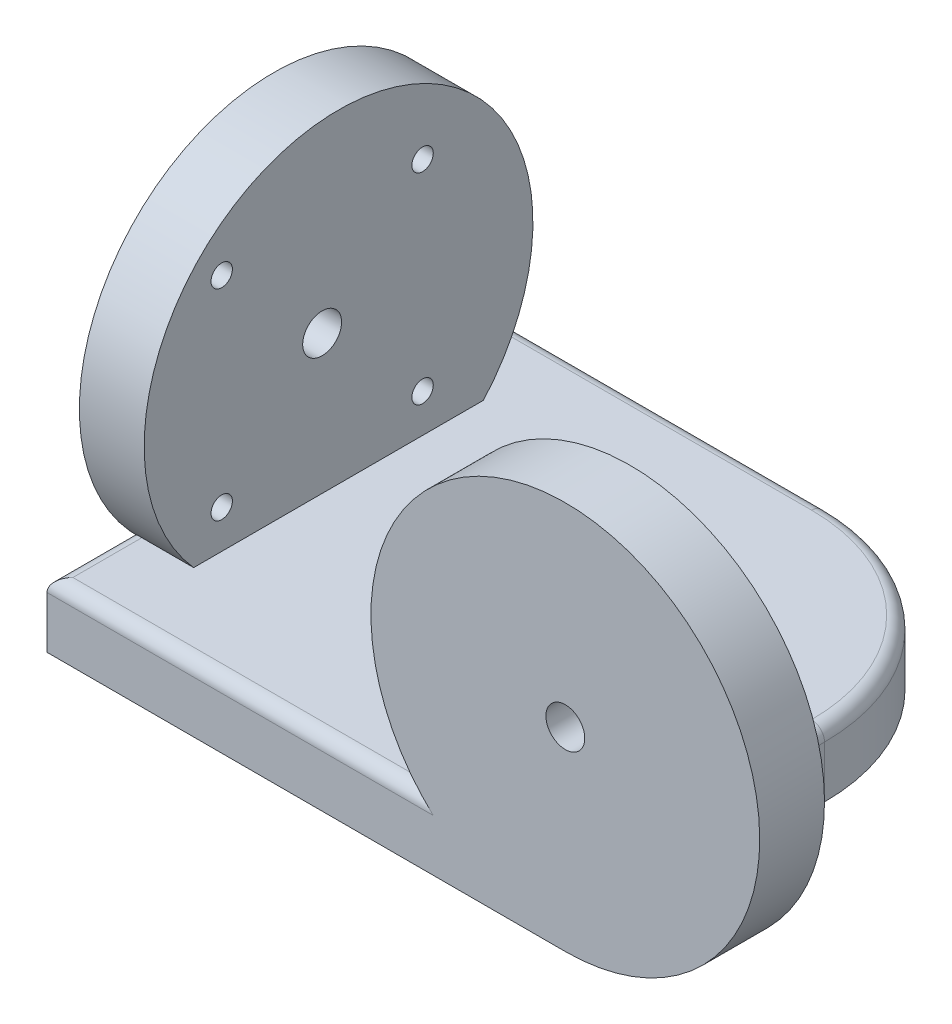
ISO-10303-21;
HEADER;
FILE_DESCRIPTION(('STEP AP214'),'2;1');
FILE_NAME('part.step','',(''),(''),'','','');
FILE_SCHEMA(('AUTOMOTIVE_DESIGN { 1 0 10303 214 1 1 1 1 }'));
ENDSEC;
DATA;
#1=APPLICATION_CONTEXT('core data for automotive mechanical design processes');
#2=APPLICATION_PROTOCOL_DEFINITION('international standard','automotive_design',2000,#1);
#3=PRODUCT_CONTEXT('',#1,'mechanical');
#4=PRODUCT('Part','Part','',(#3));
#5=PRODUCT_RELATED_PRODUCT_CATEGORY('part','',(#4));
#6=PRODUCT_DEFINITION_FORMATION('','',#4);
#7=PRODUCT_DEFINITION_CONTEXT('part definition',#1,'design');
#8=PRODUCT_DEFINITION('design','',#6,#7);
#9=PRODUCT_DEFINITION_SHAPE('','',#8);
#10=(LENGTH_UNIT() NAMED_UNIT(*) SI_UNIT(.MILLI.,.METRE.));
#11=(NAMED_UNIT(*) PLANE_ANGLE_UNIT() SI_UNIT($,.RADIAN.));
#12=(NAMED_UNIT(*) SI_UNIT($,.STERADIAN.) SOLID_ANGLE_UNIT());
#13=UNCERTAINTY_MEASURE_WITH_UNIT(LENGTH_MEASURE(1.E-05),#10,'distance_accuracy_value','');
#14=(GEOMETRIC_REPRESENTATION_CONTEXT(3) GLOBAL_UNCERTAINTY_ASSIGNED_CONTEXT((#13)) GLOBAL_UNIT_ASSIGNED_CONTEXT((#10,
#11,#12)) REPRESENTATION_CONTEXT('',''));
#15=CARTESIAN_POINT('',(0.,0.,0.));
#16=DIRECTION('',(0.,0.,1.));
#17=DIRECTION('',(1.,0.,0.));
#18=AXIS2_PLACEMENT_3D('',#15,#16,#17);
#19=CARTESIAN_POINT('',(0.,0.,10.));
#20=DIRECTION('',(0.,0.,-1.));
#21=DIRECTION('',(-1.,0.,0.));
#22=AXIS2_PLACEMENT_3D('',#19,#20,#21);
#23=CYLINDRICAL_SURFACE('',#22,30.);
#24=CARTESIAN_POINT('',(0.,0.,10.));
#25=DIRECTION('',(0.,0.,1.));
#26=DIRECTION('',(1.,0.,0.));
#27=AXIS2_PLACEMENT_3D('',#24,#25,#26);
#28=CIRCLE('',#27,30.);
#29=CARTESIAN_POINT('',(0.,-30.,10.));
#30=VERTEX_POINT('',#29);
#31=CARTESIAN_POINT('',(-20.3960780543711,-22.,10.));
#32=VERTEX_POINT('',#31);
#33=EDGE_CURVE('E54',#30,#32,#28,.T.);
#34=ORIENTED_EDGE('',*,*,#33,.F.);
#35=DIRECTION('',(0.,0.,1.));
#36=VECTOR('',#35,1.);
#37=CARTESIAN_POINT('',(0.,-30.,-60.));
#38=LINE('',#37,#36);
#39=CARTESIAN_POINT('',(0.,-30.,0.));
#40=VERTEX_POINT('',#39);
#41=EDGE_CURVE('E251',#40,#30,#38,.T.);
#42=ORIENTED_EDGE('',*,*,#41,.F.);
#43=CARTESIAN_POINT('',(0.,0.,0.));
#44=DIRECTION('',(0.,0.,1.));
#45=DIRECTION('',(1.,0.,0.));
#46=AXIS2_PLACEMENT_3D('',#43,#44,#45);
#47=CIRCLE('',#46,30.);
#48=CARTESIAN_POINT('',(-22.3606797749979,-20.,0.));
#49=VERTEX_POINT('',#48);
#50=EDGE_CURVE('E256',#40,#49,#47,.T.);
#51=ORIENTED_EDGE('',*,*,#50,.T.);
#52=DIRECTION('',(0.,0.,-1.));
#53=VECTOR('',#52,1.);
#54=CARTESIAN_POINT('',(-22.3606797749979,-20.,10.));
#55=LINE('',#54,#53);
#56=CARTESIAN_POINT('',(-22.3606797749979,-20.,8.));
#57=VERTEX_POINT('',#56);
#58=EDGE_CURVE('E250',#49,#57,#55,.F.);
#59=ORIENTED_EDGE('',*,*,#58,.T.);
#60=CARTESIAN_POINT('',(-22.3606797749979,-20.,8.));
#61=CARTESIAN_POINT('',(-22.3606878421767,-19.999989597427,8.04591763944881));
#62=CARTESIAN_POINT('',(-22.3592656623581,-20.0015809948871,8.09182840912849));
#63=CARTESIAN_POINT('',(-22.3536230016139,-20.0078877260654,8.18323544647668));
#64=CARTESIAN_POINT('',(-22.349404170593,-20.0126012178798,8.22873194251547));
#65=CARTESIAN_POINT('',(-22.3382692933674,-20.0250290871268,8.3186495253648));
#66=CARTESIAN_POINT('',(-22.3313722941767,-20.0327222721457,8.36307590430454));
#67=CARTESIAN_POINT('',(-22.3149970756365,-20.0509614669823,8.45084482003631));
#68=CARTESIAN_POINT('',(-22.3055185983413,-20.0615077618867,8.49418724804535));
#69=CARTESIAN_POINT('',(-22.2734531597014,-20.0971218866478,8.62196357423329));
#70=CARTESIAN_POINT('',(-22.2472017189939,-20.1262036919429,8.70441633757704));
#71=CARTESIAN_POINT('',(-22.1862528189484,-20.1933711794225,8.86225880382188));
#72=CARTESIAN_POINT('',(-22.1515401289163,-20.23147309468,8.93763542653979));
#73=CARTESIAN_POINT('',(-22.0621200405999,-20.3290076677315,9.10454011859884));
#74=CARTESIAN_POINT('',(-22.0046208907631,-20.3912962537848,9.19290860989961));
#75=CARTESIAN_POINT('',(-21.8800368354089,-20.5249207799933,9.35469472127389));
#76=CARTESIAN_POINT('',(-21.8129385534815,-20.5962693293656,9.42809112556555));
#77=CARTESIAN_POINT('',(-21.6466107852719,-20.7712158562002,9.58373545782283));
#78=CARTESIAN_POINT('',(-21.54439847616,-20.8773090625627,9.65996651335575));
#79=CARTESIAN_POINT('',(-21.3309886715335,-21.095315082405,9.78818478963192));
#80=CARTESIAN_POINT('',(-21.2197650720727,-21.2072444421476,9.84009839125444));
#81=CARTESIAN_POINT('',(-21.0485020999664,-21.3767886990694,9.90137564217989));
#82=CARTESIAN_POINT('',(-20.990560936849,-21.4336893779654,9.91905376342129));
#83=CARTESIAN_POINT('',(-20.8734930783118,-21.5477133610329,9.94908010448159));
#84=CARTESIAN_POINT('',(-20.8143662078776,-21.6048366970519,9.96142753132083));
#85=CARTESIAN_POINT('',(-20.6957282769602,-21.718506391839,9.980924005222));
#86=CARTESIAN_POINT('',(-20.6362250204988,-21.7750534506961,9.98811729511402));
#87=CARTESIAN_POINT('',(-20.5165822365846,-21.8878192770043,9.99765053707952));
#88=CARTESIAN_POINT('',(-20.4564430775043,-21.9440382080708,9.99999315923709));
#89=CARTESIAN_POINT('',(-20.3960780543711,-22.,10.));
#90=B_SPLINE_CURVE_WITH_KNOTS('',3,(#60,#61,#62,#63,#64,#65,#66,#67,#68,#69,#70,#71,#72,#73,#74,
#75,#76,#77,#78,#79,#80,#81,#82,#83,#84,#85,#86,#87,#88,#89),.UNSPECIFIED.,.F.,.F.,(4,2,2,2,2,2,
2,2,2,2,2,2,2,2,4),(0.,0.137692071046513,0.275302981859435,0.41195262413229,0.548615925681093,
0.821129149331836,1.09413658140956,1.45947886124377,1.82533529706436,2.3203016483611,
2.81675693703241,3.06594369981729,3.31516751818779,3.5622255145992,3.80914748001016),.UNSPECIFIED.);
#91=EDGE_CURVE('E11',#57,#32,#90,.T.);
#92=ORIENTED_EDGE('',*,*,#91,.T.);
#93=EDGE_LOOP('',(#34,#42,#51,#59,#92));
#94=FACE_BOUND('',#93,.T.);
#95=ADVANCED_FACE('F36',(#94),#23,.T.);
#96=CARTESIAN_POINT('',(0.,0.,10.));
#97=DIRECTION('',(0.,0.,1.));
#98=DIRECTION('',(1.,0.,0.));
#99=AXIS2_PLACEMENT_3D('',#96,#97,#98);
#100=PLANE('',#99);
#101=CARTESIAN_POINT('',(0.,0.,10.));
#102=DIRECTION('',(0.,0.,-1.));
#103=DIRECTION('',(-1.,0.,0.));
#104=AXIS2_PLACEMENT_3D('',#101,#102,#103);
#105=CIRCLE('',#104,3.);
#106=CARTESIAN_POINT('',(-3.,0.,10.));
#107=VERTEX_POINT('',#106);
#108=EDGE_CURVE('E222',#107,#107,#105,.T.);
#109=ORIENTED_EDGE('',*,*,#108,.T.);
#110=EDGE_LOOP('',(#109));
#111=FACE_BOUND('',#110,.T.);
#112=ORIENTED_EDGE('',*,*,#33,.T.);
#113=DIRECTION('',(-1.,0.,0.));
#114=VECTOR('',#113,1.);
#115=CARTESIAN_POINT('',(0.,-22.,10.));
#116=LINE('',#115,#114);
#117=CARTESIAN_POINT('',(-80.,-22.,10.));
#118=VERTEX_POINT('',#117);
#119=EDGE_CURVE('E294',#32,#118,#116,.T.);
#120=ORIENTED_EDGE('',*,*,#119,.T.);
#121=DIRECTION('',(0.,-1.,0.));
#122=VECTOR('',#121,1.);
#123=CARTESIAN_POINT('',(-80.,-30.,10.));
#124=LINE('',#123,#122);
#125=CARTESIAN_POINT('',(-80.,-30.,10.));
#126=VERTEX_POINT('',#125);
#127=EDGE_CURVE('E238',#118,#126,#124,.T.);
#128=ORIENTED_EDGE('',*,*,#127,.T.);
#129=DIRECTION('',(1.,0.,0.));
#130=VECTOR('',#129,1.);
#131=CARTESIAN_POINT('',(0.,-30.,10.));
#132=LINE('',#131,#130);
#133=EDGE_CURVE('E242',#126,#30,#132,.T.);
#134=ORIENTED_EDGE('',*,*,#133,.T.);
#135=EDGE_LOOP('',(#112,#120,#128,#134));
#136=FACE_BOUND('',#135,.T.);
#137=ADVANCED_FACE('F342',(#111,#136),#100,.T.);
#138=CARTESIAN_POINT('',(0.,0.,0.));
#139=DIRECTION('',(0.,0.,1.));
#140=DIRECTION('',(1.,0.,0.));
#141=AXIS2_PLACEMENT_3D('',#138,#139,#140);
#142=PLANE('',#141);
#143=CARTESIAN_POINT('',(15.5,15.5,0.));
#144=DIRECTION('',(0.,0.,-1.));
#145=DIRECTION('',(-1.,0.,0.));
#146=AXIS2_PLACEMENT_3D('',#143,#144,#145);
#147=CIRCLE('',#146,1.64999999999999);
#148=CARTESIAN_POINT('',(13.85,15.5,0.));
#149=VERTEX_POINT('',#148);
#150=EDGE_CURVE('E195',#149,#149,#147,.T.);
#151=ORIENTED_EDGE('',*,*,#150,.F.);
#152=EDGE_LOOP('',(#151));
#153=FACE_BOUND('',#152,.T.);
#154=CARTESIAN_POINT('',(-15.5,15.5,0.));
#155=DIRECTION('',(0.,0.,-1.));
#156=DIRECTION('',(-1.,0.,0.));
#157=AXIS2_PLACEMENT_3D('',#154,#155,#156);
#158=CIRCLE('',#157,1.64999999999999);
#159=CARTESIAN_POINT('',(-17.15,15.5,0.));
#160=VERTEX_POINT('',#159);
#161=EDGE_CURVE('E201',#160,#160,#158,.T.);
#162=ORIENTED_EDGE('',*,*,#161,.F.);
#163=EDGE_LOOP('',(#162));
#164=FACE_BOUND('',#163,.T.);
#165=CARTESIAN_POINT('',(-15.5,-15.5,0.));
#166=DIRECTION('',(0.,0.,-1.));
#167=DIRECTION('',(-1.,0.,0.));
#168=AXIS2_PLACEMENT_3D('',#165,#166,#167);
#169=CIRCLE('',#168,1.64999999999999);
#170=CARTESIAN_POINT('',(-17.15,-15.5,0.));
#171=VERTEX_POINT('',#170);
#172=EDGE_CURVE('E207',#171,#171,#169,.T.);
#173=ORIENTED_EDGE('',*,*,#172,.F.);
#174=EDGE_LOOP('',(#173));
#175=FACE_BOUND('',#174,.T.);
#176=CARTESIAN_POINT('',(15.5,-15.5,0.));
#177=DIRECTION('',(0.,0.,-1.));
#178=DIRECTION('',(-1.,0.,0.));
#179=AXIS2_PLACEMENT_3D('',#176,#177,#178);
#180=CIRCLE('',#179,1.64999999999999);
#181=CARTESIAN_POINT('',(13.85,-15.5,0.));
#182=VERTEX_POINT('',#181);
#183=EDGE_CURVE('E213',#182,#182,#180,.T.);
#184=ORIENTED_EDGE('',*,*,#183,.F.);
#185=EDGE_LOOP('',(#184));
#186=FACE_BOUND('',#185,.T.);
#187=CARTESIAN_POINT('',(0.,0.,0.));
#188=DIRECTION('',(0.,0.,-1.));
#189=DIRECTION('',(-1.,0.,0.));
#190=AXIS2_PLACEMENT_3D('',#187,#188,#189);
#191=CIRCLE('',#190,2.99999999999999);
#192=CARTESIAN_POINT('',(-2.99999999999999,0.,0.));
#193=VERTEX_POINT('',#192);
#194=EDGE_CURVE('E219',#193,#193,#191,.T.);
#195=ORIENTED_EDGE('',*,*,#194,.F.);
#196=EDGE_LOOP('',(#195));
#197=FACE_BOUND('',#196,.T.);
#198=ORIENTED_EDGE('',*,*,#50,.F.);
#199=DIRECTION('',(0.,1.,0.));
#200=VECTOR('',#199,1.);
#201=CARTESIAN_POINT('',(0.,0.,0.));
#202=LINE('',#201,#200);
#203=CARTESIAN_POINT('',(0.,-22.,0.));
#204=VERTEX_POINT('',#203);
#205=EDGE_CURVE('E262',#40,#204,#202,.T.);
#206=ORIENTED_EDGE('',*,*,#205,.T.);
#207=CARTESIAN_POINT('',(-2.,-22.,0.));
#208=DIRECTION('',(0.,0.,1.));
#209=DIRECTION('',(1.,0.,0.));
#210=AXIS2_PLACEMENT_3D('',#207,#208,#209);
#211=CIRCLE('',#210,2.);
#212=CARTESIAN_POINT('',(-2.,-20.,0.));
#213=VERTEX_POINT('',#212);
#214=EDGE_CURVE('E46',#204,#213,#211,.T.);
#215=ORIENTED_EDGE('',*,*,#214,.T.);
#216=DIRECTION('',(-1.,0.,0.));
#217=VECTOR('',#216,1.);
#218=CARTESIAN_POINT('',(0.,-20.,0.));
#219=LINE('',#218,#217);
#220=EDGE_CURVE('E258',#213,#49,#219,.T.);
#221=ORIENTED_EDGE('',*,*,#220,.T.);
#222=EDGE_LOOP('',(#198,#206,#215,#221));
#223=FACE_BOUND('',#222,.T.);
#224=ADVANCED_FACE('F341',(#153,#164,#175,#186,#197,#223),#142,.F.);
#225=CARTESIAN_POINT('',(0.,-30.,-60.));
#226=DIRECTION('',(1.,0.,0.));
#227=DIRECTION('',(0.,0.,-1.));
#228=AXIS2_PLACEMENT_3D('',#225,#226,#227);
#229=PLANE('',#228);
#230=DIRECTION('',(0.,1.,0.));
#231=VECTOR('',#230,1.);
#232=CARTESIAN_POINT('',(0.,-20.,-30.));
#233=LINE('',#232,#231);
#234=CARTESIAN_POINT('',(0.,-30.,-30.));
#235=VERTEX_POINT('',#234);
#236=CARTESIAN_POINT('',(0.,-22.,-30.));
#237=VERTEX_POINT('',#236);
#238=EDGE_CURVE('E264',#235,#237,#233,.T.);
#239=ORIENTED_EDGE('',*,*,#238,.T.);
#240=DIRECTION('',(0.,0.,1.));
#241=VECTOR('',#240,1.);
#242=CARTESIAN_POINT('',(0.,-22.,-60.));
#243=LINE('',#242,#241);
#244=EDGE_CURVE('E61',#237,#204,#243,.T.);
#245=ORIENTED_EDGE('',*,*,#244,.T.);
#246=ORIENTED_EDGE('',*,*,#205,.F.);
#247=EDGE_CURVE('E248',#235,#40,#38,.T.);
#248=ORIENTED_EDGE('',*,*,#247,.F.);
#249=EDGE_LOOP('',(#239,#245,#246,#248));
#250=FACE_BOUND('',#249,.T.);
#251=ADVANCED_FACE('F337',(#250),#229,.T.);
#252=CARTESIAN_POINT('',(0.,-20.,-60.));
#253=DIRECTION('',(0.,1.,0.));
#254=DIRECTION('',(-1.,0.,0.));
#255=AXIS2_PLACEMENT_3D('',#252,#253,#254);
#256=PLANE('',#255);
#257=DIRECTION('',(-1.,0.,0.));
#258=VECTOR('',#257,1.);
#259=CARTESIAN_POINT('',(-80.,-20.,-58.));
#260=LINE('',#259,#258);
#261=CARTESIAN_POINT('',(-30.,-20.,-58.));
#262=VERTEX_POINT('',#261);
#263=CARTESIAN_POINT('',(-78.,-20.,-58.));
#264=VERTEX_POINT('',#263);
#265=EDGE_CURVE('E279',#262,#264,#260,.T.);
#266=ORIENTED_EDGE('',*,*,#265,.T.);
#267=DIRECTION('',(0.,0.,1.));
#268=VECTOR('',#267,1.);
#269=CARTESIAN_POINT('',(-78.,-20.,-60.));
#270=LINE('',#269,#268);
#271=CARTESIAN_POINT('',(-78.,-20.,-47.3606797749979));
#272=VERTEX_POINT('',#271);
#273=EDGE_CURVE('E282',#264,#272,#270,.T.);
#274=ORIENTED_EDGE('',*,*,#273,.T.);
#275=DIRECTION('',(-1.,0.,0.));
#276=VECTOR('',#275,1.);
#277=CARTESIAN_POINT('',(-70.,-20.,-47.3606797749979));
#278=LINE('',#277,#276);
#279=CARTESIAN_POINT('',(-70.,-20.,-47.3606797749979));
#280=VERTEX_POINT('',#279);
#281=EDGE_CURVE('E232',#280,#272,#278,.T.);
#282=ORIENTED_EDGE('',*,*,#281,.F.);
#283=DIRECTION('',(0.,0.,1.));
#284=VECTOR('',#283,1.);
#285=CARTESIAN_POINT('',(-70.,-20.,-60.));
#286=LINE('',#285,#284);
#287=CARTESIAN_POINT('',(-70.,-20.,-2.6393202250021));
#288=VERTEX_POINT('',#287);
#289=EDGE_CURVE('E235',#280,#288,#286,.T.);
#290=ORIENTED_EDGE('',*,*,#289,.T.);
#291=DIRECTION('',(-1.,0.,0.));
#292=VECTOR('',#291,1.);
#293=CARTESIAN_POINT('',(-70.,-20.,-2.6393202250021));
#294=LINE('',#293,#292);
#295=CARTESIAN_POINT('',(-78.,-20.,-2.6393202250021));
#296=VERTEX_POINT('',#295);
#297=EDGE_CURVE('E229',#296,#288,#294,.F.);
#298=ORIENTED_EDGE('',*,*,#297,.F.);
#299=DIRECTION('',(0.,0.,1.));
#300=VECTOR('',#299,1.);
#301=CARTESIAN_POINT('',(-78.,-20.,-60.));
#302=LINE('',#301,#300);
#303=CARTESIAN_POINT('',(-78.,-20.,8.));
#304=VERTEX_POINT('',#303);
#305=EDGE_CURVE('E272',#296,#304,#302,.T.);
#306=ORIENTED_EDGE('',*,*,#305,.T.);
#307=DIRECTION('',(-1.,0.,0.));
#308=VECTOR('',#307,1.);
#309=CARTESIAN_POINT('',(0.,-20.,8.));
#310=LINE('',#309,#308);
#311=EDGE_CURVE('E270',#304,#57,#310,.F.);
#312=ORIENTED_EDGE('',*,*,#311,.T.);
#313=ORIENTED_EDGE('',*,*,#58,.F.);
#314=ORIENTED_EDGE('',*,*,#220,.F.);
#315=DIRECTION('',(0.,0.,1.));
#316=VECTOR('',#315,1.);
#317=CARTESIAN_POINT('',(-2.,-20.,-60.));
#318=LINE('',#317,#316);
#319=CARTESIAN_POINT('',(-2.,-20.,-30.));
#320=VERTEX_POINT('',#319);
#321=EDGE_CURVE('E275',#213,#320,#318,.F.);
#322=ORIENTED_EDGE('',*,*,#321,.T.);
#323=CARTESIAN_POINT('',(-30.,-20.,-30.));
#324=DIRECTION('',(0.,1.,0.));
#325=DIRECTION('',(-1.,0.,0.));
#326=AXIS2_PLACEMENT_3D('',#323,#324,#325);
#327=CIRCLE('',#326,28.);
#328=EDGE_CURVE('E277',#320,#262,#327,.T.);
#329=ORIENTED_EDGE('',*,*,#328,.T.);
#330=EDGE_LOOP('',(#266,#274,#282,#290,#298,#306,#312,#313,#314,#322,#329));
#331=FACE_BOUND('',#330,.T.);
#332=ADVANCED_FACE('F330',(#331),#256,.T.);
#333=CARTESIAN_POINT('',(0.,-30.,-60.));
#334=DIRECTION('',(0.,-1.,0.));
#335=DIRECTION('',(1.,0.,0.));
#336=AXIS2_PLACEMENT_3D('',#333,#334,#335);
#337=PLANE('',#336);
#338=DIRECTION('',(1.,0.,0.));
#339=VECTOR('',#338,1.);
#340=CARTESIAN_POINT('',(0.,-30.,-60.));
#341=LINE('',#340,#339);
#342=CARTESIAN_POINT('',(-80.,-30.,-60.));
#343=VERTEX_POINT('',#342);
#344=CARTESIAN_POINT('',(-30.,-30.,-60.));
#345=VERTEX_POINT('',#344);
#346=EDGE_CURVE('E241',#343,#345,#341,.T.);
#347=ORIENTED_EDGE('',*,*,#346,.T.);
#348=CARTESIAN_POINT('',(-30.,-30.,-30.));
#349=DIRECTION('',(0.,-1.,0.));
#350=DIRECTION('',(1.,0.,0.));
#351=AXIS2_PLACEMENT_3D('',#348,#349,#350);
#352=CIRCLE('',#351,30.);
#353=EDGE_CURVE('E268',#345,#235,#352,.T.);
#354=ORIENTED_EDGE('',*,*,#353,.T.);
#355=ORIENTED_EDGE('',*,*,#247,.T.);
#356=ORIENTED_EDGE('',*,*,#41,.T.);
#357=ORIENTED_EDGE('',*,*,#133,.F.);
#358=DIRECTION('',(0.,0.,1.));
#359=VECTOR('',#358,1.);
#360=CARTESIAN_POINT('',(-80.,-30.,-60.));
#361=LINE('',#360,#359);
#362=EDGE_CURVE('E245',#343,#126,#361,.T.);
#363=ORIENTED_EDGE('',*,*,#362,.F.);
#364=EDGE_LOOP('',(#347,#354,#355,#356,#357,#363));
#365=FACE_BOUND('',#364,.T.);
#366=ADVANCED_FACE('F327',(#365),#337,.T.);
#367=CARTESIAN_POINT('',(-80.,-30.,-60.));
#368=DIRECTION('',(-1.,0.,0.));
#369=DIRECTION('',(0.,0.,1.));
#370=AXIS2_PLACEMENT_3D('',#367,#368,#369);
#371=PLANE('',#370);
#372=CARTESIAN_POINT('',(-80.,1.40707775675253,-22.4690416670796));
#373=DIRECTION('',(1.,0.,0.));
#374=DIRECTION('',(0.,0.,-1.));
#375=AXIS2_PLACEMENT_3D('',#372,#373,#374);
#376=CIRCLE('',#375,3.);
#377=CARTESIAN_POINT('',(-80.,1.40707775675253,-25.4690416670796));
#378=VERTEX_POINT('',#377);
#379=EDGE_CURVE('E192',#378,#378,#376,.T.);
#380=ORIENTED_EDGE('',*,*,#379,.T.);
#381=EDGE_LOOP('',(#380));
#382=FACE_BOUND('',#381,.T.);
#383=CARTESIAN_POINT('',(-80.,0.,-25.));
#384=DIRECTION('',(-1.,0.,0.));
#385=DIRECTION('',(0.,0.,1.));
#386=AXIS2_PLACEMENT_3D('',#383,#384,#385);
#387=CIRCLE('',#386,30.);
#388=CARTESIAN_POINT('',(-80.,-22.,-4.60392194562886));
#389=VERTEX_POINT('',#388);
#390=CARTESIAN_POINT('',(-80.,-22.,-45.3960780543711));
#391=VERTEX_POINT('',#390);
#392=EDGE_CURVE('E225',#389,#391,#387,.T.);
#393=ORIENTED_EDGE('',*,*,#392,.T.);
#394=DIRECTION('',(0.,0.,1.));
#395=VECTOR('',#394,1.);
#396=CARTESIAN_POINT('',(-80.,-22.,-60.));
#397=LINE('',#396,#395);
#398=CARTESIAN_POINT('',(-80.,-22.,-60.));
#399=VERTEX_POINT('',#398);
#400=EDGE_CURVE('E291',#391,#399,#397,.F.);
#401=ORIENTED_EDGE('',*,*,#400,.T.);
#402=DIRECTION('',(0.,-1.,0.));
#403=VECTOR('',#402,1.);
#404=CARTESIAN_POINT('',(-80.,-30.,-60.));
#405=LINE('',#404,#403);
#406=EDGE_CURVE('E239',#399,#343,#405,.T.);
#407=ORIENTED_EDGE('',*,*,#406,.T.);
#408=ORIENTED_EDGE('',*,*,#362,.T.);
#409=ORIENTED_EDGE('',*,*,#127,.F.);
#410=DIRECTION('',(0.,0.,1.));
#411=VECTOR('',#410,1.);
#412=CARTESIAN_POINT('',(-80.,-22.,-60.));
#413=LINE('',#412,#411);
#414=EDGE_CURVE('E288',#118,#389,#413,.F.);
#415=ORIENTED_EDGE('',*,*,#414,.T.);
#416=EDGE_LOOP('',(#393,#401,#407,#408,#409,#415));
#417=FACE_BOUND('',#416,.T.);
#418=ADVANCED_FACE('F325',(#382,#417),#371,.T.);
#419=CARTESIAN_POINT('',(0.,0.,-60.));
#420=DIRECTION('',(0.,0.,1.));
#421=DIRECTION('',(1.,0.,0.));
#422=AXIS2_PLACEMENT_3D('',#419,#420,#421);
#423=PLANE('',#422);
#424=ORIENTED_EDGE('',*,*,#406,.F.);
#425=DIRECTION('',(-1.,0.,0.));
#426=VECTOR('',#425,1.);
#427=CARTESIAN_POINT('',(-30.,-22.,-60.));
#428=LINE('',#427,#426);
#429=CARTESIAN_POINT('',(-30.,-22.,-60.));
#430=VERTEX_POINT('',#429);
#431=EDGE_CURVE('E284',#399,#430,#428,.F.);
#432=ORIENTED_EDGE('',*,*,#431,.T.);
#433=DIRECTION('',(0.,1.,0.));
#434=VECTOR('',#433,1.);
#435=CARTESIAN_POINT('',(-30.,-30.,-60.));
#436=LINE('',#435,#434);
#437=EDGE_CURVE('E266',#430,#345,#436,.F.);
#438=ORIENTED_EDGE('',*,*,#437,.T.);
#439=ORIENTED_EDGE('',*,*,#346,.F.);
#440=EDGE_LOOP('',(#424,#432,#438,#439));
#441=FACE_BOUND('',#440,.T.);
#442=ADVANCED_FACE('F319',(#441),#423,.F.);
#443=CARTESIAN_POINT('',(-70.,0.,-25.));
#444=DIRECTION('',(-1.,0.,0.));
#445=DIRECTION('',(0.,0.,1.));
#446=AXIS2_PLACEMENT_3D('',#443,#444,#445);
#447=CYLINDRICAL_SURFACE('',#446,30.);
#448=CARTESIAN_POINT('',(-70.,0.,-25.));
#449=DIRECTION('',(-1.,0.,0.));
#450=DIRECTION('',(0.,0.,1.));
#451=AXIS2_PLACEMENT_3D('',#448,#449,#450);
#452=CIRCLE('',#451,30.);
#453=EDGE_CURVE('E226',#288,#280,#452,.T.);
#454=ORIENTED_EDGE('',*,*,#453,.T.);
#455=ORIENTED_EDGE('',*,*,#281,.T.);
#456=CARTESIAN_POINT('',(-78.,-20.,-47.3606797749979));
#457=CARTESIAN_POINT('',(-78.0459176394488,-19.999989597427,-47.3606878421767));
#458=CARTESIAN_POINT('',(-78.0918284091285,-20.0015809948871,-47.3592656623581));
#459=CARTESIAN_POINT('',(-78.1832354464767,-20.0078877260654,-47.3536230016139));
#460=CARTESIAN_POINT('',(-78.2287319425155,-20.0126012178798,-47.349404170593));
#461=CARTESIAN_POINT('',(-78.3186495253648,-20.0250290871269,-47.3382692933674));
#462=CARTESIAN_POINT('',(-78.3630759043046,-20.0327222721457,-47.3313722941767));
#463=CARTESIAN_POINT('',(-78.4508448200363,-20.0509614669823,-47.3149970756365));
#464=CARTESIAN_POINT('',(-78.4941872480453,-20.0615077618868,-47.3055185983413));
#465=CARTESIAN_POINT('',(-78.6219635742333,-20.0971218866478,-47.2734531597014));
#466=CARTESIAN_POINT('',(-78.704416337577,-20.126203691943,-47.2472017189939));
#467=CARTESIAN_POINT('',(-78.8622588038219,-20.1933711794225,-47.1862528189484));
#468=CARTESIAN_POINT('',(-78.9376354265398,-20.23147309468,-47.1515401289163));
#469=CARTESIAN_POINT('',(-79.1045401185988,-20.3290076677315,-47.0621200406));
#470=CARTESIAN_POINT('',(-79.1929086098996,-20.3912962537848,-47.0046208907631));
#471=CARTESIAN_POINT('',(-79.3546947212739,-20.5249207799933,-46.8800368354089));
#472=CARTESIAN_POINT('',(-79.4280911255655,-20.5962693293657,-46.8129385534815));
#473=CARTESIAN_POINT('',(-79.5837354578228,-20.7712158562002,-46.6466107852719));
#474=CARTESIAN_POINT('',(-79.6599665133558,-20.8773090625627,-46.54439847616));
#475=CARTESIAN_POINT('',(-79.7881847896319,-21.095315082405,-46.3309886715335));
#476=CARTESIAN_POINT('',(-79.8400983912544,-21.2072444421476,-46.2197650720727));
#477=CARTESIAN_POINT('',(-79.9013756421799,-21.3767886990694,-46.0485020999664));
#478=CARTESIAN_POINT('',(-79.9190537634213,-21.4336893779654,-45.990560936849));
#479=CARTESIAN_POINT('',(-79.9490801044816,-21.5477133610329,-45.8734930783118));
#480=CARTESIAN_POINT('',(-79.9614275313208,-21.6048366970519,-45.8143662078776));
#481=CARTESIAN_POINT('',(-79.980924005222,-21.718506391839,-45.6957282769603));
#482=CARTESIAN_POINT('',(-79.988117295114,-21.7750534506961,-45.6362250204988));
#483=CARTESIAN_POINT('',(-79.9976505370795,-21.8878192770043,-45.5165822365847));
#484=CARTESIAN_POINT('',(-79.9999931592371,-21.9440382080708,-45.4564430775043));
#485=CARTESIAN_POINT('',(-80.,-22.,-45.3960780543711));
#486=B_SPLINE_CURVE_WITH_KNOTS('',3,(#456,#457,#458,#459,#460,#461,#462,#463,#464,#465,#466,
#467,#468,#469,#470,#471,#472,#473,#474,#475,#476,#477,#478,#479,#480,#481,#482,#483,#484,#485),
.UNSPECIFIED.,.F.,.F.,(4,2,2,2,2,2,2,2,2,2,2,2,2,2,4),(0.,0.137692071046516,0.275302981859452,
0.411952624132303,0.548615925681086,0.821129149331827,1.09413658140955,1.45947886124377,
1.82533529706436,2.3203016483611,2.81675693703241,3.06594369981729,3.31516751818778,
3.5622255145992,3.80914748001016),.UNSPECIFIED.);
#487=EDGE_CURVE('E296',#272,#391,#486,.T.);
#488=ORIENTED_EDGE('',*,*,#487,.T.);
#489=ORIENTED_EDGE('',*,*,#392,.F.);
#490=CARTESIAN_POINT('',(-80.,-22.,-4.60392194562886));
#491=CARTESIAN_POINT('',(-79.9999786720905,-21.9250969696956,-4.52311990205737));
#492=CARTESIAN_POINT('',(-79.9957893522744,-21.849713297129,-4.44270947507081));
#493=CARTESIAN_POINT('',(-79.9786015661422,-21.6983829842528,-4.28304540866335));
#494=CARTESIAN_POINT('',(-79.9655837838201,-21.6224354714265,-4.20379469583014));
#495=CARTESIAN_POINT('',(-79.9300679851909,-21.4698763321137,-4.04632308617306));
#496=CARTESIAN_POINT('',(-79.9074674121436,-21.3932665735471,-3.96812306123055));
#497=CARTESIAN_POINT('',(-79.8521922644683,-21.2410983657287,-3.814452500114));
#498=CARTESIAN_POINT('',(-79.8195278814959,-21.165538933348,-3.73897928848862));
#499=CARTESIAN_POINT('',(-79.7325264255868,-20.9950355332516,-3.57042646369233));
#500=CARTESIAN_POINT('',(-79.6746633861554,-20.9007232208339,-3.4784796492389));
#501=CARTESIAN_POINT('',(-79.5397533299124,-20.7186202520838,-3.30311860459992));
#502=CARTESIAN_POINT('',(-79.4627795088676,-20.6308063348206,-3.21967349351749));
#503=CARTESIAN_POINT('',(-79.3070493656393,-20.4832444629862,-3.08095136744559));
#504=CARTESIAN_POINT('',(-79.2321712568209,-20.4215041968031,-3.02346171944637));
#505=CARTESIAN_POINT('',(-79.069729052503,-20.3072185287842,-2.91781445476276));
#506=CARTESIAN_POINT('',(-78.9821736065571,-20.2546669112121,-2.869650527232));
#507=CARTESIAN_POINT('',(-78.8120722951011,-20.1702774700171,-2.79273579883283));
#508=CARTESIAN_POINT('',(-78.7314065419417,-20.1364178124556,-2.7620556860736));
#509=CARTESIAN_POINT('',(-78.5636540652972,-20.0790322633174,-2.71022738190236));
#510=CARTESIAN_POINT('',(-78.4765795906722,-20.0554872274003,-2.68906152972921));
#511=CARTESIAN_POINT('',(-78.3243499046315,-20.0254289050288,-2.66208405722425));
#512=CARTESIAN_POINT('',(-78.2602372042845,-20.0159477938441,-2.65359177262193));
#513=CARTESIAN_POINT('',(-78.1307701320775,-20.0032088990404,-2.64219033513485));
#514=CARTESIAN_POINT('',(-78.0654133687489,-19.999964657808,-2.63929333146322));
#515=CARTESIAN_POINT('',(-78.,-20.,-2.6393202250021));
#516=B_SPLINE_CURVE_WITH_KNOTS('',3,(#490,#491,#492,#493,#494,#495,#496,#497,#498,#499,#500,
#501,#502,#503,#504,#505,#506,#507,#508,#509,#510,#511,#512,#513,#514,#515),.UNSPECIFIED.,.F.,
.F.,(4,2,2,2,2,2,2,2,2,2,2,2,4),(0.,0.330515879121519,0.661757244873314,0.996636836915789,
1.33117840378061,1.7613310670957,2.18986096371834,2.52703574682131,2.86398155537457,
3.14098050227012,3.41746312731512,3.61303525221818,3.80903155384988),.UNSPECIFIED.);
#517=EDGE_CURVE('E304',#389,#296,#516,.T.);
#518=ORIENTED_EDGE('',*,*,#517,.T.);
#519=ORIENTED_EDGE('',*,*,#297,.T.);
#520=EDGE_LOOP('',(#454,#455,#488,#489,#518,#519));
#521=FACE_BOUND('',#520,.T.);
#522=ADVANCED_FACE('F313',(#521),#447,.T.);
#523=CARTESIAN_POINT('',(-70.,0.,-25.));
#524=DIRECTION('',(-1.,0.,0.));
#525=DIRECTION('',(0.,0.,1.));
#526=AXIS2_PLACEMENT_3D('',#523,#524,#525);
#527=PLANE('',#526);
#528=CARTESIAN_POINT('',(-70.,16.9070777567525,-6.96904166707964));
#529=DIRECTION('',(1.,0.,0.));
#530=DIRECTION('',(0.,0.,-1.));
#531=AXIS2_PLACEMENT_3D('',#528,#529,#530);
#532=CIRCLE('',#531,1.64999999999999);
#533=CARTESIAN_POINT('',(-70.,16.9070777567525,-8.61904166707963));
#534=VERTEX_POINT('',#533);
#535=EDGE_CURVE('E166',#534,#534,#532,.T.);
#536=ORIENTED_EDGE('',*,*,#535,.F.);
#537=EDGE_LOOP('',(#536));
#538=FACE_BOUND('',#537,.T.);
#539=CARTESIAN_POINT('',(-70.,16.9070777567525,-37.9690416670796));
#540=DIRECTION('',(1.,0.,0.));
#541=DIRECTION('',(0.,0.,-1.));
#542=AXIS2_PLACEMENT_3D('',#539,#540,#541);
#543=CIRCLE('',#542,1.64999999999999);
#544=CARTESIAN_POINT('',(-70.,16.9070777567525,-39.6190416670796));
#545=VERTEX_POINT('',#544);
#546=EDGE_CURVE('E165',#545,#545,#543,.T.);
#547=ORIENTED_EDGE('',*,*,#546,.F.);
#548=EDGE_LOOP('',(#547));
#549=FACE_BOUND('',#548,.T.);
#550=CARTESIAN_POINT('',(-70.,-14.0929222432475,-37.9690416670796));
#551=DIRECTION('',(1.,0.,0.));
#552=DIRECTION('',(0.,0.,-1.));
#553=AXIS2_PLACEMENT_3D('',#550,#551,#552);
#554=CIRCLE('',#553,1.64999999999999);
#555=CARTESIAN_POINT('',(-70.,-14.0929222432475,-39.6190416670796));
#556=VERTEX_POINT('',#555);
#557=EDGE_CURVE('E177',#556,#556,#554,.T.);
#558=ORIENTED_EDGE('',*,*,#557,.F.);
#559=EDGE_LOOP('',(#558));
#560=FACE_BOUND('',#559,.T.);
#561=CARTESIAN_POINT('',(-70.,-14.0929222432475,-6.96904166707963));
#562=DIRECTION('',(1.,0.,0.));
#563=DIRECTION('',(0.,0.,-1.));
#564=AXIS2_PLACEMENT_3D('',#561,#562,#563);
#565=CIRCLE('',#564,1.64999999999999);
#566=CARTESIAN_POINT('',(-70.,-14.0929222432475,-8.61904166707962));
#567=VERTEX_POINT('',#566);
#568=EDGE_CURVE('E183',#567,#567,#565,.T.);
#569=ORIENTED_EDGE('',*,*,#568,.F.);
#570=EDGE_LOOP('',(#569));
#571=FACE_BOUND('',#570,.T.);
#572=CARTESIAN_POINT('',(-70.,1.40707775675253,-22.4690416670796));
#573=DIRECTION('',(1.,0.,0.));
#574=DIRECTION('',(0.,0.,-1.));
#575=AXIS2_PLACEMENT_3D('',#572,#573,#574);
#576=CIRCLE('',#575,2.99999999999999);
#577=CARTESIAN_POINT('',(-70.,1.40707775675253,-25.4690416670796));
#578=VERTEX_POINT('',#577);
#579=EDGE_CURVE('E189',#578,#578,#576,.T.);
#580=ORIENTED_EDGE('',*,*,#579,.F.);
#581=EDGE_LOOP('',(#580));
#582=FACE_BOUND('',#581,.T.);
#583=ORIENTED_EDGE('',*,*,#289,.F.);
#584=ORIENTED_EDGE('',*,*,#453,.F.);
#585=EDGE_LOOP('',(#583,#584));
#586=FACE_BOUND('',#585,.T.);
#587=ADVANCED_FACE('F318',(#538,#549,#560,#571,#582,#586),#527,.F.);
#588=CARTESIAN_POINT('',(0.,0.,0.));
#589=DIRECTION('',(0.,0.,-1.));
#590=DIRECTION('',(-1.,0.,0.));
#591=AXIS2_PLACEMENT_3D('',#588,#589,#590);
#592=CYLINDRICAL_SURFACE('',#591,2.99999999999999);
#593=ORIENTED_EDGE('',*,*,#108,.F.);
#594=EDGE_LOOP('',(#593));
#595=FACE_BOUND('',#594,.T.);
#596=ORIENTED_EDGE('',*,*,#194,.T.);
#597=EDGE_LOOP('',(#596));
#598=FACE_BOUND('',#597,.T.);
#599=ADVANCED_FACE('F402',(#595,#598),#592,.F.);
#600=CARTESIAN_POINT('',(15.5,-15.5,6.));
#601=DIRECTION('',(0.,0.,-1.));
#602=DIRECTION('',(-1.,0.,0.));
#603=AXIS2_PLACEMENT_3D('',#600,#601,#602);
#604=CONICAL_SURFACE('',#603,1.65,1.02974425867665);
#605=CARTESIAN_POINT('',(15.5,-15.5,6.99142002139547));
#606=VERTEX_POINT('',#605);
#607=VERTEX_LOOP('',#606);
#608=FACE_BOUND('',#607,.T.);
#609=CARTESIAN_POINT('',(15.5,-15.5,6.));
#610=DIRECTION('',(0.,0.,-1.));
#611=DIRECTION('',(-1.,0.,0.));
#612=AXIS2_PLACEMENT_3D('',#609,#610,#611);
#613=CIRCLE('',#612,1.65);
#614=CARTESIAN_POINT('',(13.85,-15.5,6.));
#615=VERTEX_POINT('',#614);
#616=EDGE_CURVE('E216',#615,#615,#613,.T.);
#617=ORIENTED_EDGE('',*,*,#616,.T.);
#618=EDGE_LOOP('',(#617));
#619=FACE_BOUND('',#618,.T.);
#620=ADVANCED_FACE('F407',(#608,#619),#604,.F.);
#621=CARTESIAN_POINT('',(15.5,-15.5,0.));
#622=DIRECTION('',(0.,0.,-1.));
#623=DIRECTION('',(-1.,0.,0.));
#624=AXIS2_PLACEMENT_3D('',#621,#622,#623);
#625=CYLINDRICAL_SURFACE('',#624,1.64999999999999);
#626=ORIENTED_EDGE('',*,*,#616,.F.);
#627=EDGE_LOOP('',(#626));
#628=FACE_BOUND('',#627,.T.);
#629=ORIENTED_EDGE('',*,*,#183,.T.);
#630=EDGE_LOOP('',(#629));
#631=FACE_BOUND('',#630,.T.);
#632=ADVANCED_FACE('F456',(#628,#631),#625,.F.);
#633=CARTESIAN_POINT('',(-15.5,-15.5,6.));
#634=DIRECTION('',(0.,0.,-1.));
#635=DIRECTION('',(-1.,0.,0.));
#636=AXIS2_PLACEMENT_3D('',#633,#634,#635);
#637=CONICAL_SURFACE('',#636,1.65,1.02974425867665);
#638=CARTESIAN_POINT('',(-15.5,-15.5,6.99142002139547));
#639=VERTEX_POINT('',#638);
#640=VERTEX_LOOP('',#639);
#641=FACE_BOUND('',#640,.T.);
#642=CARTESIAN_POINT('',(-15.5,-15.5,6.));
#643=DIRECTION('',(0.,0.,-1.));
#644=DIRECTION('',(-1.,0.,0.));
#645=AXIS2_PLACEMENT_3D('',#642,#643,#644);
#646=CIRCLE('',#645,1.65);
#647=CARTESIAN_POINT('',(-17.15,-15.5,6.));
#648=VERTEX_POINT('',#647);
#649=EDGE_CURVE('E210',#648,#648,#646,.T.);
#650=ORIENTED_EDGE('',*,*,#649,.T.);
#651=EDGE_LOOP('',(#650));
#652=FACE_BOUND('',#651,.T.);
#653=ADVANCED_FACE('F452',(#641,#652),#637,.F.);
#654=CARTESIAN_POINT('',(-15.5,-15.5,0.));
#655=DIRECTION('',(0.,0.,-1.));
#656=DIRECTION('',(-1.,0.,0.));
#657=AXIS2_PLACEMENT_3D('',#654,#655,#656);
#658=CYLINDRICAL_SURFACE('',#657,1.64999999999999);
#659=ORIENTED_EDGE('',*,*,#649,.F.);
#660=EDGE_LOOP('',(#659));
#661=FACE_BOUND('',#660,.T.);
#662=ORIENTED_EDGE('',*,*,#172,.T.);
#663=EDGE_LOOP('',(#662));
#664=FACE_BOUND('',#663,.T.);
#665=ADVANCED_FACE('F448',(#661,#664),#658,.F.);
#666=CARTESIAN_POINT('',(-15.5,15.5,6.));
#667=DIRECTION('',(0.,0.,-1.));
#668=DIRECTION('',(-1.,0.,0.));
#669=AXIS2_PLACEMENT_3D('',#666,#667,#668);
#670=CONICAL_SURFACE('',#669,1.65,1.02974425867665);
#671=CARTESIAN_POINT('',(-15.5,15.5,6.99142002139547));
#672=VERTEX_POINT('',#671);
#673=VERTEX_LOOP('',#672);
#674=FACE_BOUND('',#673,.T.);
#675=CARTESIAN_POINT('',(-15.5,15.5,6.));
#676=DIRECTION('',(0.,0.,-1.));
#677=DIRECTION('',(-1.,0.,0.));
#678=AXIS2_PLACEMENT_3D('',#675,#676,#677);
#679=CIRCLE('',#678,1.65);
#680=CARTESIAN_POINT('',(-17.15,15.5,6.));
#681=VERTEX_POINT('',#680);
#682=EDGE_CURVE('E204',#681,#681,#679,.T.);
#683=ORIENTED_EDGE('',*,*,#682,.T.);
#684=EDGE_LOOP('',(#683));
#685=FACE_BOUND('',#684,.T.);
#686=ADVANCED_FACE('F444',(#674,#685),#670,.F.);
#687=CARTESIAN_POINT('',(-15.5,15.5,0.));
#688=DIRECTION('',(0.,0.,-1.));
#689=DIRECTION('',(-1.,0.,0.));
#690=AXIS2_PLACEMENT_3D('',#687,#688,#689);
#691=CYLINDRICAL_SURFACE('',#690,1.64999999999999);
#692=ORIENTED_EDGE('',*,*,#682,.F.);
#693=EDGE_LOOP('',(#692));
#694=FACE_BOUND('',#693,.T.);
#695=ORIENTED_EDGE('',*,*,#161,.T.);
#696=EDGE_LOOP('',(#695));
#697=FACE_BOUND('',#696,.T.);
#698=ADVANCED_FACE('F440',(#694,#697),#691,.F.);
#699=CARTESIAN_POINT('',(15.5,15.5,6.));
#700=DIRECTION('',(0.,0.,-1.));
#701=DIRECTION('',(-1.,0.,0.));
#702=AXIS2_PLACEMENT_3D('',#699,#700,#701);
#703=CONICAL_SURFACE('',#702,1.65,1.02974425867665);
#704=CARTESIAN_POINT('',(15.5,15.5,6.99142002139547));
#705=VERTEX_POINT('',#704);
#706=VERTEX_LOOP('',#705);
#707=FACE_BOUND('',#706,.T.);
#708=CARTESIAN_POINT('',(15.5,15.5,6.));
#709=DIRECTION('',(0.,0.,-1.));
#710=DIRECTION('',(-1.,0.,0.));
#711=AXIS2_PLACEMENT_3D('',#708,#709,#710);
#712=CIRCLE('',#711,1.65);
#713=CARTESIAN_POINT('',(13.85,15.5,6.));
#714=VERTEX_POINT('',#713);
#715=EDGE_CURVE('E198',#714,#714,#712,.T.);
#716=ORIENTED_EDGE('',*,*,#715,.T.);
#717=EDGE_LOOP('',(#716));
#718=FACE_BOUND('',#717,.T.);
#719=ADVANCED_FACE('F432',(#707,#718),#703,.F.);
#720=CARTESIAN_POINT('',(15.5,15.5,0.));
#721=DIRECTION('',(0.,0.,-1.));
#722=DIRECTION('',(-1.,0.,0.));
#723=AXIS2_PLACEMENT_3D('',#720,#721,#722);
#724=CYLINDRICAL_SURFACE('',#723,1.64999999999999);
#725=ORIENTED_EDGE('',*,*,#715,.F.);
#726=EDGE_LOOP('',(#725));
#727=FACE_BOUND('',#726,.T.);
#728=ORIENTED_EDGE('',*,*,#150,.T.);
#729=EDGE_LOOP('',(#728));
#730=FACE_BOUND('',#729,.T.);
#731=ADVANCED_FACE('F422',(#727,#730),#724,.F.);
#732=CARTESIAN_POINT('',(-70.,1.40707775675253,-22.4690416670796));
#733=DIRECTION('',(1.,0.,0.));
#734=DIRECTION('',(0.,0.,-1.));
#735=AXIS2_PLACEMENT_3D('',#732,#733,#734);
#736=CYLINDRICAL_SURFACE('',#735,2.99999999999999);
#737=ORIENTED_EDGE('',*,*,#379,.F.);
#738=EDGE_LOOP('',(#737));
#739=FACE_BOUND('',#738,.T.);
#740=ORIENTED_EDGE('',*,*,#579,.T.);
#741=EDGE_LOOP('',(#740));
#742=FACE_BOUND('',#741,.T.);
#743=ADVANCED_FACE('F419',(#739,#742),#736,.F.);
#744=CARTESIAN_POINT('',(-76.,-14.0929222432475,-6.96904166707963));
#745=DIRECTION('',(1.,0.,0.));
#746=DIRECTION('',(0.,0.,-1.));
#747=AXIS2_PLACEMENT_3D('',#744,#745,#746);
#748=CONICAL_SURFACE('',#747,1.65,1.02974425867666);
#749=CARTESIAN_POINT('',(-76.9914200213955,-14.0929222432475,-6.96904166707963));
#750=VERTEX_POINT('',#749);
#751=VERTEX_LOOP('',#750);
#752=FACE_BOUND('',#751,.T.);
#753=CARTESIAN_POINT('',(-76.,-14.0929222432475,-6.96904166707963));
#754=DIRECTION('',(1.,0.,0.));
#755=DIRECTION('',(0.,0.,-1.));
#756=AXIS2_PLACEMENT_3D('',#753,#754,#755);
#757=CIRCLE('',#756,1.65);
#758=CARTESIAN_POINT('',(-76.,-14.0929222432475,-8.61904166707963));
#759=VERTEX_POINT('',#758);
#760=EDGE_CURVE('E186',#759,#759,#757,.T.);
#761=ORIENTED_EDGE('',*,*,#760,.T.);
#762=EDGE_LOOP('',(#761));
#763=FACE_BOUND('',#762,.T.);
#764=ADVANCED_FACE('F421',(#752,#763),#748,.F.);
#765=CARTESIAN_POINT('',(-70.,-14.0929222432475,-6.96904166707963));
#766=DIRECTION('',(1.,0.,0.));
#767=DIRECTION('',(0.,0.,-1.));
#768=AXIS2_PLACEMENT_3D('',#765,#766,#767);
#769=CYLINDRICAL_SURFACE('',#768,1.64999999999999);
#770=ORIENTED_EDGE('',*,*,#760,.F.);
#771=EDGE_LOOP('',(#770));
#772=FACE_BOUND('',#771,.T.);
#773=ORIENTED_EDGE('',*,*,#568,.T.);
#774=EDGE_LOOP('',(#773));
#775=FACE_BOUND('',#774,.T.);
#776=ADVANCED_FACE('F429',(#772,#775),#769,.F.);
#777=CARTESIAN_POINT('',(-76.,-14.0929222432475,-37.9690416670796));
#778=DIRECTION('',(1.,0.,0.));
#779=DIRECTION('',(0.,0.,-1.));
#780=AXIS2_PLACEMENT_3D('',#777,#778,#779);
#781=CONICAL_SURFACE('',#780,1.65,1.02974425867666);
#782=CARTESIAN_POINT('',(-76.9914200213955,-14.0929222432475,-37.9690416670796));
#783=VERTEX_POINT('',#782);
#784=VERTEX_LOOP('',#783);
#785=FACE_BOUND('',#784,.T.);
#786=CARTESIAN_POINT('',(-76.,-14.0929222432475,-37.9690416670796));
#787=DIRECTION('',(1.,0.,0.));
#788=DIRECTION('',(0.,0.,-1.));
#789=AXIS2_PLACEMENT_3D('',#786,#787,#788);
#790=CIRCLE('',#789,1.65);
#791=CARTESIAN_POINT('',(-76.,-14.0929222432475,-39.6190416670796));
#792=VERTEX_POINT('',#791);
#793=EDGE_CURVE('E180',#792,#792,#790,.T.);
#794=ORIENTED_EDGE('',*,*,#793,.T.);
#795=EDGE_LOOP('',(#794));
#796=FACE_BOUND('',#795,.T.);
#797=ADVANCED_FACE('F515',(#785,#796),#781,.F.);
#798=CARTESIAN_POINT('',(-70.,-14.0929222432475,-37.9690416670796));
#799=DIRECTION('',(1.,0.,0.));
#800=DIRECTION('',(0.,0.,-1.));
#801=AXIS2_PLACEMENT_3D('',#798,#799,#800);
#802=CYLINDRICAL_SURFACE('',#801,1.64999999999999);
#803=ORIENTED_EDGE('',*,*,#793,.F.);
#804=EDGE_LOOP('',(#803));
#805=FACE_BOUND('',#804,.T.);
#806=ORIENTED_EDGE('',*,*,#557,.T.);
#807=EDGE_LOOP('',(#806));
#808=FACE_BOUND('',#807,.T.);
#809=ADVANCED_FACE('F522',(#805,#808),#802,.F.);
#810=CARTESIAN_POINT('',(-76.,16.9070777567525,-37.9690416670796));
#811=DIRECTION('',(1.,0.,0.));
#812=DIRECTION('',(0.,0.,-1.));
#813=AXIS2_PLACEMENT_3D('',#810,#811,#812);
#814=CONICAL_SURFACE('',#813,1.65,1.02974425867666);
#815=CARTESIAN_POINT('',(-76.9914200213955,16.9070777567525,-37.9690416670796));
#816=VERTEX_POINT('',#815);
#817=VERTEX_LOOP('',#816);
#818=FACE_BOUND('',#817,.T.);
#819=CARTESIAN_POINT('',(-76.,16.9070777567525,-37.9690416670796));
#820=DIRECTION('',(1.,0.,0.));
#821=DIRECTION('',(0.,0.,-1.));
#822=AXIS2_PLACEMENT_3D('',#819,#820,#821);
#823=CIRCLE('',#822,1.65);
#824=CARTESIAN_POINT('',(-76.,16.9070777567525,-39.6190416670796));
#825=VERTEX_POINT('',#824);
#826=EDGE_CURVE('E169',#825,#825,#823,.T.);
#827=ORIENTED_EDGE('',*,*,#826,.T.);
#828=EDGE_LOOP('',(#827));
#829=FACE_BOUND('',#828,.T.);
#830=ADVANCED_FACE('F526',(#818,#829),#814,.F.);
#831=CARTESIAN_POINT('',(-70.,16.9070777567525,-37.9690416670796));
#832=DIRECTION('',(1.,0.,0.));
#833=DIRECTION('',(0.,0.,-1.));
#834=AXIS2_PLACEMENT_3D('',#831,#832,#833);
#835=CYLINDRICAL_SURFACE('',#834,1.65);
#836=ORIENTED_EDGE('',*,*,#826,.F.);
#837=EDGE_LOOP('',(#836));
#838=FACE_BOUND('',#837,.T.);
#839=ORIENTED_EDGE('',*,*,#546,.T.);
#840=EDGE_LOOP('',(#839));
#841=FACE_BOUND('',#840,.T.);
#842=ADVANCED_FACE('F159',(#838,#841),#835,.F.);
#843=CARTESIAN_POINT('',(-76.,16.9070777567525,-6.96904166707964));
#844=DIRECTION('',(1.,0.,0.));
#845=DIRECTION('',(0.,0.,-1.));
#846=AXIS2_PLACEMENT_3D('',#843,#844,#845);
#847=CONICAL_SURFACE('',#846,1.65,1.02974425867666);
#848=CARTESIAN_POINT('',(-76.9914200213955,16.9070777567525,-6.96904166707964));
#849=VERTEX_POINT('',#848);
#850=VERTEX_LOOP('',#849);
#851=FACE_BOUND('',#850,.T.);
#852=CARTESIAN_POINT('',(-76.,16.9070777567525,-6.96904166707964));
#853=DIRECTION('',(1.,0.,0.));
#854=DIRECTION('',(0.,0.,-1.));
#855=AXIS2_PLACEMENT_3D('',#852,#853,#854);
#856=CIRCLE('',#855,1.65);
#857=CARTESIAN_POINT('',(-76.,16.9070777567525,-8.61904166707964));
#858=VERTEX_POINT('',#857);
#859=EDGE_CURVE('E163',#858,#858,#856,.T.);
#860=ORIENTED_EDGE('',*,*,#859,.T.);
#861=EDGE_LOOP('',(#860));
#862=FACE_BOUND('',#861,.T.);
#863=ADVANCED_FACE('F155',(#851,#862),#847,.F.);
#864=CARTESIAN_POINT('',(-70.,16.9070777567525,-6.96904166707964));
#865=DIRECTION('',(1.,0.,0.));
#866=DIRECTION('',(0.,0.,-1.));
#867=AXIS2_PLACEMENT_3D('',#864,#865,#866);
#868=CYLINDRICAL_SURFACE('',#867,1.65);
#869=ORIENTED_EDGE('',*,*,#859,.F.);
#870=EDGE_LOOP('',(#869));
#871=FACE_BOUND('',#870,.T.);
#872=ORIENTED_EDGE('',*,*,#535,.T.);
#873=EDGE_LOOP('',(#872));
#874=FACE_BOUND('',#873,.T.);
#875=ADVANCED_FACE('F158',(#871,#874),#868,.F.);
#876=CARTESIAN_POINT('',(-30.,-30.,-30.));
#877=DIRECTION('',(0.,-1.,0.));
#878=DIRECTION('',(0.,0.,-1.));
#879=AXIS2_PLACEMENT_3D('',#876,#877,#878);
#880=CYLINDRICAL_SURFACE('',#879,30.);
#881=ORIENTED_EDGE('',*,*,#437,.F.);
#882=CARTESIAN_POINT('',(-30.,-22.,-30.));
#883=DIRECTION('',(0.,1.,0.));
#884=DIRECTION('',(-1.,0.,0.));
#885=AXIS2_PLACEMENT_3D('',#882,#883,#884);
#886=CIRCLE('',#885,30.);
#887=EDGE_CURVE('E286',#430,#237,#886,.F.);
#888=ORIENTED_EDGE('',*,*,#887,.T.);
#889=ORIENTED_EDGE('',*,*,#238,.F.);
#890=ORIENTED_EDGE('',*,*,#353,.F.);
#891=EDGE_LOOP('',(#881,#888,#889,#890));
#892=FACE_BOUND('',#891,.T.);
#893=ADVANCED_FACE('F353',(#892),#880,.T.);
#894=CARTESIAN_POINT('',(-2.,-22.,-60.));
#895=DIRECTION('',(0.,0.,1.));
#896=DIRECTION('',(1.,0.,0.));
#897=AXIS2_PLACEMENT_3D('',#894,#895,#896);
#898=CYLINDRICAL_SURFACE('',#897,2.);
#899=ORIENTED_EDGE('',*,*,#214,.F.);
#900=ORIENTED_EDGE('',*,*,#244,.F.);
#901=CARTESIAN_POINT('',(-2.,-22.,-30.));
#902=DIRECTION('',(0.,0.,-1.));
#903=DIRECTION('',(-1.,0.,0.));
#904=AXIS2_PLACEMENT_3D('',#901,#902,#903);
#905=CIRCLE('',#904,2.);
#906=EDGE_CURVE('E172',#320,#237,#905,.T.);
#907=ORIENTED_EDGE('',*,*,#906,.F.);
#908=ORIENTED_EDGE('',*,*,#321,.F.);
#909=EDGE_LOOP('',(#899,#900,#907,#908));
#910=FACE_BOUND('',#909,.T.);
#911=ADVANCED_FACE('F372',(#910),#898,.T.);
#912=CARTESIAN_POINT('',(-30.,-22.,-30.));
#913=DIRECTION('',(0.,1.,0.));
#914=DIRECTION('',(-1.,0.,0.));
#915=AXIS2_PLACEMENT_3D('',#912,#913,#914);
#916=TOROIDAL_SURFACE('',#915,28.,2.);
#917=ORIENTED_EDGE('',*,*,#906,.T.);
#918=ORIENTED_EDGE('',*,*,#887,.F.);
#919=CARTESIAN_POINT('',(-30.,-22.,-58.));
#920=DIRECTION('',(-1.,0.,0.));
#921=DIRECTION('',(0.,0.,1.));
#922=AXIS2_PLACEMENT_3D('',#919,#920,#921);
#923=CIRCLE('',#922,2.);
#924=EDGE_CURVE('E360',#262,#430,#923,.T.);
#925=ORIENTED_EDGE('',*,*,#924,.F.);
#926=ORIENTED_EDGE('',*,*,#328,.F.);
#927=EDGE_LOOP('',(#917,#918,#925,#926));
#928=FACE_BOUND('',#927,.T.);
#929=ADVANCED_FACE('F367',(#928),#916,.T.);
#930=CARTESIAN_POINT('',(-78.,-22.,-60.));
#931=DIRECTION('',(0.,0.,1.));
#932=DIRECTION('',(1.,0.,0.));
#933=AXIS2_PLACEMENT_3D('',#930,#931,#932);
#934=CYLINDRICAL_SURFACE('',#933,2.);
#935=ORIENTED_EDGE('',*,*,#487,.F.);
#936=ORIENTED_EDGE('',*,*,#273,.F.);
#937=CARTESIAN_POINT('',(-78.,-22.,-58.));
#938=DIRECTION('',(-0.707106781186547,0.,0.707106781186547));
#939=DIRECTION('',(0.707106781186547,0.,0.707106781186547));
#940=AXIS2_PLACEMENT_3D('',#937,#938,#939);
#941=ELLIPSE('',#940,2.82842712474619,2.);
#942=EDGE_CURVE('E358',#399,#264,#941,.F.);
#943=ORIENTED_EDGE('',*,*,#942,.F.);
#944=ORIENTED_EDGE('',*,*,#400,.F.);
#945=EDGE_LOOP('',(#935,#936,#943,#944));
#946=FACE_BOUND('',#945,.T.);
#947=ADVANCED_FACE('F309',(#946),#934,.T.);
#948=CARTESIAN_POINT('',(0.,-22.,-58.));
#949=DIRECTION('',(1.,0.,0.));
#950=DIRECTION('',(0.,1.,0.));
#951=AXIS2_PLACEMENT_3D('',#948,#949,#950);
#952=CYLINDRICAL_SURFACE('',#951,2.);
#953=ORIENTED_EDGE('',*,*,#924,.T.);
#954=ORIENTED_EDGE('',*,*,#431,.F.);
#955=ORIENTED_EDGE('',*,*,#942,.T.);
#956=ORIENTED_EDGE('',*,*,#265,.F.);
#957=EDGE_LOOP('',(#953,#954,#955,#956));
#958=FACE_BOUND('',#957,.T.);
#959=ADVANCED_FACE('F394',(#958),#952,.T.);
#960=CARTESIAN_POINT('',(0.,-22.,8.));
#961=DIRECTION('',(-1.,0.,0.));
#962=DIRECTION('',(0.,-1.,0.));
#963=AXIS2_PLACEMENT_3D('',#960,#961,#962);
#964=CYLINDRICAL_SURFACE('',#963,2.);
#965=ORIENTED_EDGE('',*,*,#91,.F.);
#966=ORIENTED_EDGE('',*,*,#311,.F.);
#967=CARTESIAN_POINT('',(-78.,-22.,8.));
#968=DIRECTION('',(-0.707106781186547,0.,-0.707106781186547));
#969=DIRECTION('',(-0.707106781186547,0.,0.707106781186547));
#970=AXIS2_PLACEMENT_3D('',#967,#968,#969);
#971=ELLIPSE('',#970,2.82842712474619,2.);
#972=EDGE_CURVE('E41',#118,#304,#971,.T.);
#973=ORIENTED_EDGE('',*,*,#972,.F.);
#974=ORIENTED_EDGE('',*,*,#119,.F.);
#975=EDGE_LOOP('',(#965,#966,#973,#974));
#976=FACE_BOUND('',#975,.T.);
#977=ADVANCED_FACE('F38',(#976),#964,.T.);
#978=CARTESIAN_POINT('',(-78.,-22.,-60.));
#979=DIRECTION('',(0.,0.,1.));
#980=DIRECTION('',(1.,0.,0.));
#981=AXIS2_PLACEMENT_3D('',#978,#979,#980);
#982=CYLINDRICAL_SURFACE('',#981,2.);
#983=ORIENTED_EDGE('',*,*,#517,.F.);
#984=ORIENTED_EDGE('',*,*,#414,.F.);
#985=ORIENTED_EDGE('',*,*,#972,.T.);
#986=ORIENTED_EDGE('',*,*,#305,.F.);
#987=EDGE_LOOP('',(#983,#984,#985,#986));
#988=FACE_BOUND('',#987,.T.);
#989=ADVANCED_FACE('F382',(#988),#982,.T.);
#990=CLOSED_SHELL('',(#95,#137,#224,#251,#332,#366,#418,#442,#522,#587,#599,#620,#632,#653,#665,
#686,#698,#719,#731,#743,#764,#776,#797,#809,#830,#842,#863,#875,#893,#911,#929,#947,#959,#977,#989));
#991=MANIFOLD_SOLID_BREP('B2',#990);
#992=ADVANCED_BREP_SHAPE_REPRESENTATION('',(#18,#991),#14);
#993=SHAPE_DEFINITION_REPRESENTATION(#9,#992);
ENDSEC;
END-ISO-10303-21;
